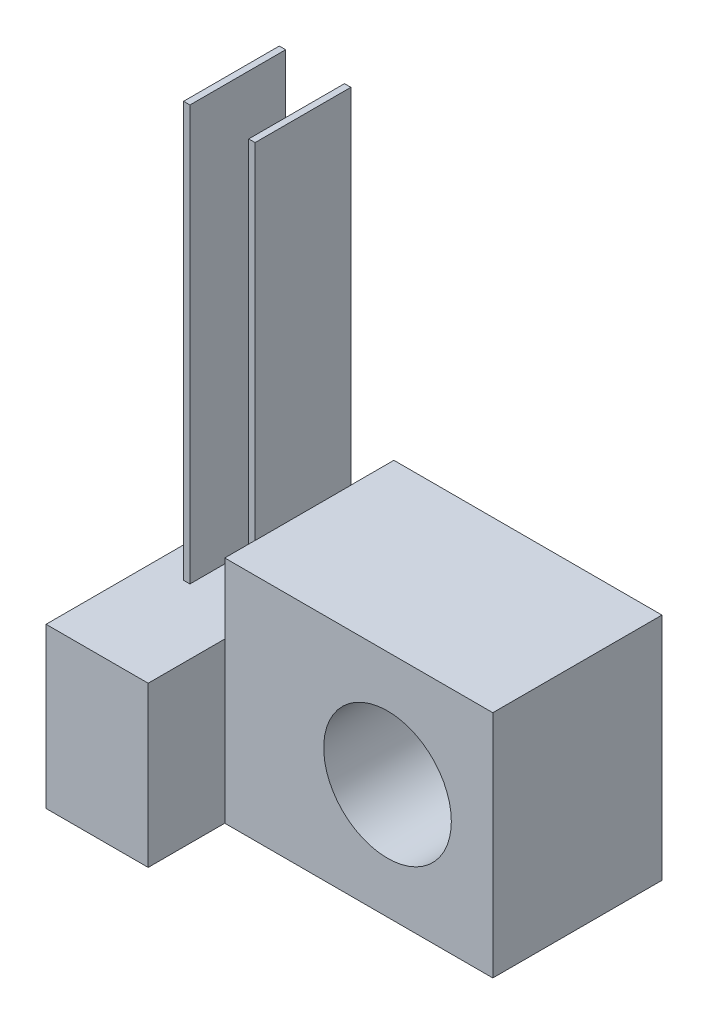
ISO-10303-21;
HEADER;
FILE_DESCRIPTION(('STEP AP214'),'2;1');
FILE_NAME('part.step','',(''),(''),'','','');
FILE_SCHEMA(('AUTOMOTIVE_DESIGN { 1 0 10303 214 1 1 1 1 }'));
ENDSEC;
DATA;
#1=APPLICATION_CONTEXT('core data for automotive mechanical design processes');
#2=APPLICATION_PROTOCOL_DEFINITION('international standard','automotive_design',2000,#1);
#3=PRODUCT_CONTEXT('',#1,'mechanical');
#4=PRODUCT('Part','Part','',(#3));
#5=PRODUCT_RELATED_PRODUCT_CATEGORY('part','',(#4));
#6=PRODUCT_DEFINITION_FORMATION('','',#4);
#7=PRODUCT_DEFINITION_CONTEXT('part definition',#1,'design');
#8=PRODUCT_DEFINITION('design','',#6,#7);
#9=PRODUCT_DEFINITION_SHAPE('','',#8);
#10=(LENGTH_UNIT() NAMED_UNIT(*) SI_UNIT(.MILLI.,.METRE.));
#11=(NAMED_UNIT(*) PLANE_ANGLE_UNIT() SI_UNIT($,.RADIAN.));
#12=(NAMED_UNIT(*) SI_UNIT($,.STERADIAN.) SOLID_ANGLE_UNIT());
#13=UNCERTAINTY_MEASURE_WITH_UNIT(LENGTH_MEASURE(1.E-05),#10,'distance_accuracy_value','');
#14=(GEOMETRIC_REPRESENTATION_CONTEXT(3) GLOBAL_UNCERTAINTY_ASSIGNED_CONTEXT((#13)) GLOBAL_UNIT_ASSIGNED_CONTEXT((#10,
#11,#12)) REPRESENTATION_CONTEXT('',''));
#15=CARTESIAN_POINT('',(0.,0.,0.));
#16=DIRECTION('',(0.,0.,1.));
#17=DIRECTION('',(1.,0.,0.));
#18=AXIS2_PLACEMENT_3D('',#15,#16,#17);
#19=CARTESIAN_POINT('',(9.55,56.6995708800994,-500000.));
#20=DIRECTION('',(0.,1.,0.));
#21=DIRECTION('',(0.,0.,1.));
#22=AXIS2_PLACEMENT_3D('',#19,#20,#21);
#23=PLANE('',#22);
#24=DIRECTION('',(0.,0.,1.));
#25=VECTOR('',#24,1.);
#26=CARTESIAN_POINT('',(9.45160588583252,56.6995708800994,0.675963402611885));
#27=LINE('',#26,#25);
#28=CARTESIAN_POINT('',(9.45160588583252,56.6995708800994,0.675963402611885));
#29=VERTEX_POINT('',#28);
#30=CARTESIAN_POINT('',(9.45160588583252,56.6995708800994,2.17596340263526));
#31=VERTEX_POINT('',#30);
#32=EDGE_CURVE('E181',#29,#31,#27,.T.);
#33=ORIENTED_EDGE('',*,*,#32,.F.);
#34=DIRECTION('',(1.,0.,0.));
#35=VECTOR('',#34,1.);
#36=CARTESIAN_POINT('',(9.55000000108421,56.6995708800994,0.675963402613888));
#37=LINE('',#36,#35);
#38=CARTESIAN_POINT('',(9.55,56.6995708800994,0.675963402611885));
#39=VERTEX_POINT('',#38);
#40=EDGE_CURVE('E55',#29,#39,#37,.T.);
#41=ORIENTED_EDGE('',*,*,#40,.T.);
#42=DIRECTION('',(0.,0.,1.));
#43=VECTOR('',#42,1.);
#44=CARTESIAN_POINT('',(9.55,56.6995708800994,-500000.));
#45=LINE('',#44,#43);
#46=CARTESIAN_POINT('',(9.55,56.6995708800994,0.));
#47=VERTEX_POINT('',#46);
#48=EDGE_CURVE('E285',#47,#39,#45,.T.);
#49=ORIENTED_EDGE('',*,*,#48,.F.);
#50=DIRECTION('',(-1.,0.,0.));
#51=VECTOR('',#50,1.);
#52=CARTESIAN_POINT('',(9.55,56.6995708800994,0.));
#53=LINE('',#52,#51);
#54=CARTESIAN_POINT('',(7.95,56.6995708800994,0.));
#55=VERTEX_POINT('',#54);
#56=EDGE_CURVE('E365',#47,#55,#53,.T.);
#57=ORIENTED_EDGE('',*,*,#56,.T.);
#58=DIRECTION('',(0.,0.,1.));
#59=VECTOR('',#58,1.);
#60=CARTESIAN_POINT('',(7.95,56.6995708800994,-500000.));
#61=LINE('',#60,#59);
#62=CARTESIAN_POINT('',(7.95,56.6995708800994,3.85000000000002));
#63=VERTEX_POINT('',#62);
#64=EDGE_CURVE('E296',#55,#63,#61,.T.);
#65=ORIENTED_EDGE('',*,*,#64,.T.);
#66=DIRECTION('',(-1.,0.,0.));
#67=VECTOR('',#66,1.);
#68=CARTESIAN_POINT('',(9.55,56.6995708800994,3.85000000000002));
#69=LINE('',#68,#67);
#70=CARTESIAN_POINT('',(9.55,56.6995708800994,3.85000000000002));
#71=VERTEX_POINT('',#70);
#72=EDGE_CURVE('E248',#71,#63,#69,.T.);
#73=ORIENTED_EDGE('',*,*,#72,.F.);
#74=DIRECTION('',(0.,0.,-1.));
#75=VECTOR('',#74,1.);
#76=CARTESIAN_POINT('',(9.55,56.6995708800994,3.85000000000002));
#77=LINE('',#76,#75);
#78=CARTESIAN_POINT('',(9.55,56.6995708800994,2.65000000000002));
#79=VERTEX_POINT('',#78);
#80=EDGE_CURVE('E257',#71,#79,#77,.T.);
#81=ORIENTED_EDGE('',*,*,#80,.T.);
#82=CARTESIAN_POINT('',(9.55,56.6995708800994,2.17596340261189));
#83=VERTEX_POINT('',#82);
#84=EDGE_CURVE('E297',#83,#79,#45,.T.);
#85=ORIENTED_EDGE('',*,*,#84,.F.);
#86=DIRECTION('',(1.,0.,0.));
#87=VECTOR('',#86,1.);
#88=CARTESIAN_POINT('',(9.55160588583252,56.6995708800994,2.17596340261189));
#89=LINE('',#88,#87);
#90=EDGE_CURVE('E211',#31,#83,#89,.T.);
#91=ORIENTED_EDGE('',*,*,#90,.F.);
#92=EDGE_LOOP('',(#33,#41,#49,#57,#65,#73,#81,#85,#91));
#93=FACE_BOUND('',#92,.T.);
#94=DIRECTION('',(-1.,0.,0.));
#95=VECTOR('',#94,1.);
#96=CARTESIAN_POINT('',(8.53060997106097,56.6995708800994,0.675963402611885));
#97=LINE('',#96,#95);
#98=CARTESIAN_POINT('',(8.53060997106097,56.6995708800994,0.675963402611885));
#99=VERTEX_POINT('',#98);
#100=CARTESIAN_POINT('',(8.43060997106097,56.6995708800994,0.675963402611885));
#101=VERTEX_POINT('',#100);
#102=EDGE_CURVE('E175',#99,#101,#97,.T.);
#103=ORIENTED_EDGE('',*,*,#102,.F.);
#104=DIRECTION('',(0.,0.,-1.));
#105=VECTOR('',#104,1.);
#106=CARTESIAN_POINT('',(8.53060997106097,56.6995708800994,0.675963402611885));
#107=LINE('',#106,#105);
#108=CARTESIAN_POINT('',(8.53060997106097,56.6995708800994,2.17596340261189));
#109=VERTEX_POINT('',#108);
#110=EDGE_CURVE('E186',#109,#99,#107,.T.);
#111=ORIENTED_EDGE('',*,*,#110,.F.);
#112=DIRECTION('',(1.,0.,0.));
#113=VECTOR('',#112,1.);
#114=CARTESIAN_POINT('',(8.53060997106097,56.6995708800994,2.17596340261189));
#115=LINE('',#114,#113);
#116=CARTESIAN_POINT('',(8.43060997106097,56.6995708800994,2.17596340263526));
#117=VERTEX_POINT('',#116);
#118=EDGE_CURVE('E196',#117,#109,#115,.T.);
#119=ORIENTED_EDGE('',*,*,#118,.F.);
#120=DIRECTION('',(0.,0.,1.));
#121=VECTOR('',#120,1.);
#122=CARTESIAN_POINT('',(8.43060997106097,56.6995708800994,0.675963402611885));
#123=LINE('',#122,#121);
#124=EDGE_CURVE('E194',#101,#117,#123,.T.);
#125=ORIENTED_EDGE('',*,*,#124,.F.);
#126=EDGE_LOOP('',(#103,#111,#119,#125));
#127=FACE_BOUND('',#126,.T.);
#128=ADVANCED_FACE('F47',(#93,#127),#23,.T.);
#129=CARTESIAN_POINT('',(13.75,57.7995708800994,-500000.));
#130=DIRECTION('',(0.,1.,0.));
#131=DIRECTION('',(0.,0.,1.));
#132=AXIS2_PLACEMENT_3D('',#129,#130,#131);
#133=PLANE('',#132);
#134=DIRECTION('',(0.,0.,1.));
#135=VECTOR('',#134,1.);
#136=CARTESIAN_POINT('',(9.55,57.7995708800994,-500000.));
#137=LINE('',#136,#135);
#138=CARTESIAN_POINT('',(9.55,57.7995708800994,0.));
#139=VERTEX_POINT('',#138);
#140=CARTESIAN_POINT('',(9.55,57.7995708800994,0.675963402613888));
#141=VERTEX_POINT('',#140);
#142=EDGE_CURVE('E301',#139,#141,#137,.T.);
#143=ORIENTED_EDGE('',*,*,#142,.T.);
#144=DIRECTION('',(1.,0.,0.));
#145=VECTOR('',#144,1.);
#146=CARTESIAN_POINT('',(13.7500000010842,57.7995708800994,0.675963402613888));
#147=LINE('',#146,#145);
#148=CARTESIAN_POINT('',(9.55160588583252,57.7995708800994,0.675963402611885));
#149=VERTEX_POINT('',#148);
#150=EDGE_CURVE('E241',#141,#149,#147,.T.);
#151=ORIENTED_EDGE('',*,*,#150,.T.);
#152=DIRECTION('',(0.,0.,1.));
#153=VECTOR('',#152,1.);
#154=CARTESIAN_POINT('',(9.55160588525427,57.7995708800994,-500000.));
#155=LINE('',#154,#153);
#156=CARTESIAN_POINT('',(9.55160588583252,57.7995708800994,2.17596340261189));
#157=VERTEX_POINT('',#156);
#158=EDGE_CURVE('E12',#149,#157,#155,.T.);
#159=ORIENTED_EDGE('',*,*,#158,.T.);
#160=DIRECTION('',(-1.,0.,0.));
#161=VECTOR('',#160,1.);
#162=CARTESIAN_POINT('',(13.75,57.7995708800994,2.17596340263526));
#163=LINE('',#162,#161);
#164=CARTESIAN_POINT('',(9.55,57.7995708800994,2.17596340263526));
#165=VERTEX_POINT('',#164);
#166=EDGE_CURVE('E235',#157,#165,#163,.T.);
#167=ORIENTED_EDGE('',*,*,#166,.T.);
#168=CARTESIAN_POINT('',(9.55,57.7995708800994,2.65000000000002));
#169=VERTEX_POINT('',#168);
#170=EDGE_CURVE('E396',#165,#169,#137,.T.);
#171=ORIENTED_EDGE('',*,*,#170,.T.);
#172=DIRECTION('',(-1.,0.,0.));
#173=VECTOR('',#172,1.);
#174=CARTESIAN_POINT('',(13.75,57.7995708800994,2.65000000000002));
#175=LINE('',#174,#173);
#176=CARTESIAN_POINT('',(13.75,57.7995708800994,2.65000000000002));
#177=VERTEX_POINT('',#176);
#178=EDGE_CURVE('E383',#177,#169,#175,.T.);
#179=ORIENTED_EDGE('',*,*,#178,.F.);
#180=DIRECTION('',(0.,0.,1.));
#181=VECTOR('',#180,1.);
#182=CARTESIAN_POINT('',(13.75,57.7995708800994,-500000.));
#183=LINE('',#182,#181);
#184=CARTESIAN_POINT('',(13.75,57.7995708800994,0.));
#185=VERTEX_POINT('',#184);
#186=EDGE_CURVE('E395',#185,#177,#183,.T.);
#187=ORIENTED_EDGE('',*,*,#186,.F.);
#188=DIRECTION('',(-1.,0.,0.));
#189=VECTOR('',#188,1.);
#190=CARTESIAN_POINT('',(13.75,57.7995708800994,0.));
#191=LINE('',#190,#189);
#192=EDGE_CURVE('E388',#185,#139,#191,.T.);
#193=ORIENTED_EDGE('',*,*,#192,.T.);
#194=EDGE_LOOP('',(#143,#151,#159,#167,#171,#179,#187,#193));
#195=FACE_BOUND('',#194,.T.);
#196=ADVANCED_FACE('F338',(#195),#133,.T.);
#197=CARTESIAN_POINT('',(9.55,57.7995708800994,-500000.));
#198=DIRECTION('',(-1.,0.,0.));
#199=DIRECTION('',(0.,0.,1.));
#200=AXIS2_PLACEMENT_3D('',#197,#198,#199);
#201=PLANE('',#200);
#202=ORIENTED_EDGE('',*,*,#48,.T.);
#203=DIRECTION('',(0.,1.,0.));
#204=VECTOR('',#203,1.);
#205=CARTESIAN_POINT('',(9.55,57.7995708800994,0.675963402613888));
#206=LINE('',#205,#204);
#207=EDGE_CURVE('E238',#39,#141,#206,.T.);
#208=ORIENTED_EDGE('',*,*,#207,.T.);
#209=ORIENTED_EDGE('',*,*,#142,.F.);
#210=DIRECTION('',(0.,-1.,0.));
#211=VECTOR('',#210,1.);
#212=CARTESIAN_POINT('',(9.55,57.7995708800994,0.));
#213=LINE('',#212,#211);
#214=EDGE_CURVE('E294',#139,#47,#213,.T.);
#215=ORIENTED_EDGE('',*,*,#214,.T.);
#216=EDGE_LOOP('',(#202,#208,#209,#215));
#217=FACE_BOUND('',#216,.T.);
#218=ADVANCED_FACE('F290',(#217),#201,.T.);
#219=ORIENTED_EDGE('',*,*,#170,.F.);
#220=DIRECTION('',(0.,-1.,0.));
#221=VECTOR('',#220,1.);
#222=CARTESIAN_POINT('',(9.55,57.7995708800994,2.17596340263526));
#223=LINE('',#222,#221);
#224=EDGE_CURVE('E232',#165,#83,#223,.T.);
#225=ORIENTED_EDGE('',*,*,#224,.T.);
#226=ORIENTED_EDGE('',*,*,#84,.T.);
#227=DIRECTION('',(0.,-1.,0.));
#228=VECTOR('',#227,1.);
#229=CARTESIAN_POINT('',(9.55,57.7995708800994,2.65000000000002));
#230=LINE('',#229,#228);
#231=EDGE_CURVE('E267',#169,#79,#230,.T.);
#232=ORIENTED_EDGE('',*,*,#231,.F.);
#233=EDGE_LOOP('',(#219,#225,#226,#232));
#234=FACE_BOUND('',#233,.T.);
#235=ADVANCED_FACE('F378',(#234),#201,.T.);
#236=CARTESIAN_POINT('',(13.75,54.1995708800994,2.65000000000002));
#237=DIRECTION('',(0.,0.,-1.));
#238=DIRECTION('',(-1.,0.,0.));
#239=AXIS2_PLACEMENT_3D('',#236,#237,#238);
#240=PLANE('',#239);
#241=CARTESIAN_POINT('',(12.1,55.9995708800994,2.65000000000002));
#242=DIRECTION('',(0.,0.,1.));
#243=DIRECTION('',(1.,0.,0.));
#244=AXIS2_PLACEMENT_3D('',#241,#242,#243);
#245=CIRCLE('',#244,1.);
#246=CARTESIAN_POINT('',(13.1,55.9995708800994,2.65000000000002));
#247=VERTEX_POINT('',#246);
#248=EDGE_CURVE('E309',#247,#247,#245,.T.);
#249=ORIENTED_EDGE('',*,*,#248,.F.);
#250=EDGE_LOOP('',(#249));
#251=FACE_BOUND('',#250,.T.);
#252=DIRECTION('',(0.,1.,0.));
#253=VECTOR('',#252,1.);
#254=CARTESIAN_POINT('',(9.55,56.6995708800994,2.65000000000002));
#255=LINE('',#254,#253);
#256=CARTESIAN_POINT('',(9.55,54.1995708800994,2.65000000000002));
#257=VERTEX_POINT('',#256);
#258=EDGE_CURVE('E244',#257,#79,#255,.T.);
#259=ORIENTED_EDGE('',*,*,#258,.F.);
#260=DIRECTION('',(1.,0.,0.));
#261=VECTOR('',#260,1.);
#262=CARTESIAN_POINT('',(13.75,54.1995708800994,2.65000000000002));
#263=LINE('',#262,#261);
#264=CARTESIAN_POINT('',(13.75,54.1995708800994,2.65000000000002));
#265=VERTEX_POINT('',#264);
#266=EDGE_CURVE('E264',#257,#265,#263,.T.);
#267=ORIENTED_EDGE('',*,*,#266,.T.);
#268=DIRECTION('',(0.,1.,0.));
#269=VECTOR('',#268,1.);
#270=CARTESIAN_POINT('',(13.75,57.7995708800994,2.65000000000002));
#271=LINE('',#270,#269);
#272=EDGE_CURVE('E261',#265,#177,#271,.T.);
#273=ORIENTED_EDGE('',*,*,#272,.T.);
#274=ORIENTED_EDGE('',*,*,#178,.T.);
#275=ORIENTED_EDGE('',*,*,#231,.T.);
#276=EDGE_LOOP('',(#259,#267,#273,#274,#275));
#277=FACE_BOUND('',#276,.T.);
#278=ADVANCED_FACE('F334',(#251,#277),#240,.F.);
#279=CARTESIAN_POINT('',(9.1,55.9995708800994,-1.));
#280=DIRECTION('',(0.,0.,1.));
#281=DIRECTION('',(1.,0.,0.));
#282=AXIS2_PLACEMENT_3D('',#279,#280,#281);
#283=PLANE('',#282);
#284=CARTESIAN_POINT('',(9.1,55.9995708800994,-1.));
#285=DIRECTION('',(0.,0.,1.));
#286=DIRECTION('',(1.,0.,0.));
#287=AXIS2_PLACEMENT_3D('',#284,#285,#286);
#288=CIRCLE('',#287,0.500000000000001);
#289=CARTESIAN_POINT('',(9.6,55.9995708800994,-1.));
#290=VERTEX_POINT('',#289);
#291=EDGE_CURVE('E313',#290,#290,#288,.T.);
#292=ORIENTED_EDGE('',*,*,#291,.F.);
#293=EDGE_LOOP('',(#292));
#294=FACE_BOUND('',#293,.T.);
#295=ADVANCED_FACE('F325',(#294),#283,.F.);
#296=CARTESIAN_POINT('',(9.1,55.9995708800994,-1.));
#297=DIRECTION('',(0.,0.,1.));
#298=DIRECTION('',(1.,0.,0.));
#299=AXIS2_PLACEMENT_3D('',#296,#297,#298);
#300=CYLINDRICAL_SURFACE('',#299,0.500000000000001);
#301=ORIENTED_EDGE('',*,*,#291,.T.);
#302=EDGE_LOOP('',(#301));
#303=FACE_BOUND('',#302,.T.);
#304=CARTESIAN_POINT('',(9.1,55.9995708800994,0.));
#305=DIRECTION('',(0.,0.,1.));
#306=DIRECTION('',(1.,0.,0.));
#307=AXIS2_PLACEMENT_3D('',#304,#305,#306);
#308=CIRCLE('',#307,0.500000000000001);
#309=CARTESIAN_POINT('',(9.6,55.9995708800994,0.));
#310=VERTEX_POINT('',#309);
#311=EDGE_CURVE('E260',#310,#310,#308,.T.);
#312=ORIENTED_EDGE('',*,*,#311,.F.);
#313=EDGE_LOOP('',(#312));
#314=FACE_BOUND('',#313,.T.);
#315=ADVANCED_FACE('F323',(#303,#314),#300,.T.);
#316=CARTESIAN_POINT('',(15.,47.2495708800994,0.));
#317=DIRECTION('',(0.,0.,-1.));
#318=DIRECTION('',(-1.,0.,0.));
#319=AXIS2_PLACEMENT_3D('',#316,#317,#318);
#320=PLANE('',#319);
#321=DIRECTION('',(1.,0.,0.));
#322=VECTOR('',#321,1.);
#323=CARTESIAN_POINT('',(13.75,54.1995708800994,0.));
#324=LINE('',#323,#322);
#325=CARTESIAN_POINT('',(7.95,54.1995708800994,0.));
#326=VERTEX_POINT('',#325);
#327=CARTESIAN_POINT('',(13.75,54.1995708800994,0.));
#328=VERTEX_POINT('',#327);
#329=EDGE_CURVE('E393',#326,#328,#324,.T.);
#330=ORIENTED_EDGE('',*,*,#329,.F.);
#331=DIRECTION('',(0.,-1.,0.));
#332=VECTOR('',#331,1.);
#333=CARTESIAN_POINT('',(7.95,56.6995708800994,0.));
#334=LINE('',#333,#332);
#335=EDGE_CURVE('E363',#55,#326,#334,.T.);
#336=ORIENTED_EDGE('',*,*,#335,.F.);
#337=ORIENTED_EDGE('',*,*,#56,.F.);
#338=ORIENTED_EDGE('',*,*,#214,.F.);
#339=ORIENTED_EDGE('',*,*,#192,.F.);
#340=DIRECTION('',(0.,1.,0.));
#341=VECTOR('',#340,1.);
#342=CARTESIAN_POINT('',(13.75,57.7995708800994,0.));
#343=LINE('',#342,#341);
#344=EDGE_CURVE('E312',#328,#185,#343,.T.);
#345=ORIENTED_EDGE('',*,*,#344,.F.);
#346=EDGE_LOOP('',(#330,#336,#337,#338,#339,#345));
#347=FACE_BOUND('',#346,.T.);
#348=ORIENTED_EDGE('',*,*,#311,.T.);
#349=EDGE_LOOP('',(#348));
#350=FACE_BOUND('',#349,.T.);
#351=CARTESIAN_POINT('',(12.1,55.9995708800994,0.));
#352=DIRECTION('',(0.,0.,-1.));
#353=DIRECTION('',(-1.,0.,0.));
#354=AXIS2_PLACEMENT_3D('',#351,#352,#353);
#355=CIRCLE('',#354,1.);
#356=CARTESIAN_POINT('',(11.1,55.9995708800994,0.));
#357=VERTEX_POINT('',#356);
#358=EDGE_CURVE('E310',#357,#357,#355,.F.);
#359=ORIENTED_EDGE('',*,*,#358,.T.);
#360=EDGE_LOOP('',(#359));
#361=FACE_BOUND('',#360,.T.);
#362=ADVANCED_FACE('F320',(#347,#350,#361),#320,.T.);
#363=CARTESIAN_POINT('',(12.1,55.9995708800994,-500000.));
#364=DIRECTION('',(0.,0.,1.));
#365=DIRECTION('',(1.,0.,0.));
#366=AXIS2_PLACEMENT_3D('',#363,#364,#365);
#367=CYLINDRICAL_SURFACE('',#366,1.);
#368=ORIENTED_EDGE('',*,*,#358,.F.);
#369=EDGE_LOOP('',(#368));
#370=FACE_BOUND('',#369,.T.);
#371=ORIENTED_EDGE('',*,*,#248,.T.);
#372=EDGE_LOOP('',(#371));
#373=FACE_BOUND('',#372,.T.);
#374=ADVANCED_FACE('F331',(#370,#373),#367,.F.);
#375=CARTESIAN_POINT('',(13.75,57.7995708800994,-500000.));
#376=DIRECTION('',(1.,0.,0.));
#377=DIRECTION('',(0.,0.,-1.));
#378=AXIS2_PLACEMENT_3D('',#375,#376,#377);
#379=PLANE('',#378);
#380=DIRECTION('',(0.,0.,1.));
#381=VECTOR('',#380,1.);
#382=CARTESIAN_POINT('',(13.75,54.1995708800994,-500000.));
#383=LINE('',#382,#381);
#384=EDGE_CURVE('E306',#328,#265,#383,.T.);
#385=ORIENTED_EDGE('',*,*,#384,.F.);
#386=ORIENTED_EDGE('',*,*,#344,.T.);
#387=ORIENTED_EDGE('',*,*,#186,.T.);
#388=ORIENTED_EDGE('',*,*,#272,.F.);
#389=EDGE_LOOP('',(#385,#386,#387,#388));
#390=FACE_BOUND('',#389,.T.);
#391=ADVANCED_FACE('F348',(#390),#379,.T.);
#392=CARTESIAN_POINT('',(7.95,56.6995708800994,-500000.));
#393=DIRECTION('',(-1.,0.,0.));
#394=DIRECTION('',(0.,0.,1.));
#395=AXIS2_PLACEMENT_3D('',#392,#393,#394);
#396=PLANE('',#395);
#397=ORIENTED_EDGE('',*,*,#64,.F.);
#398=ORIENTED_EDGE('',*,*,#335,.T.);
#399=DIRECTION('',(0.,0.,1.));
#400=VECTOR('',#399,1.);
#401=CARTESIAN_POINT('',(7.95,54.1995708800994,-500000.));
#402=LINE('',#401,#400);
#403=CARTESIAN_POINT('',(7.95,54.1995708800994,3.85000000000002));
#404=VERTEX_POINT('',#403);
#405=EDGE_CURVE('E299',#326,#404,#402,.T.);
#406=ORIENTED_EDGE('',*,*,#405,.T.);
#407=DIRECTION('',(0.,-1.,0.));
#408=VECTOR('',#407,1.);
#409=CARTESIAN_POINT('',(7.95,56.6995708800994,3.85000000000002));
#410=LINE('',#409,#408);
#411=EDGE_CURVE('E251',#63,#404,#410,.T.);
#412=ORIENTED_EDGE('',*,*,#411,.F.);
#413=EDGE_LOOP('',(#397,#398,#406,#412));
#414=FACE_BOUND('',#413,.T.);
#415=ADVANCED_FACE('F350',(#414),#396,.T.);
#416=CARTESIAN_POINT('',(13.75,54.1995708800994,-500000.));
#417=DIRECTION('',(0.,-1.,0.));
#418=DIRECTION('',(0.,0.,-1.));
#419=AXIS2_PLACEMENT_3D('',#416,#417,#418);
#420=PLANE('',#419);
#421=ORIENTED_EDGE('',*,*,#405,.F.);
#422=ORIENTED_EDGE('',*,*,#329,.T.);
#423=ORIENTED_EDGE('',*,*,#384,.T.);
#424=ORIENTED_EDGE('',*,*,#266,.F.);
#425=DIRECTION('',(0.,0.,-1.));
#426=VECTOR('',#425,1.);
#427=CARTESIAN_POINT('',(9.55,54.1995708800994,3.85000000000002));
#428=LINE('',#427,#426);
#429=CARTESIAN_POINT('',(9.55,54.1995708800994,3.85000000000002));
#430=VERTEX_POINT('',#429);
#431=EDGE_CURVE('E256',#430,#257,#428,.T.);
#432=ORIENTED_EDGE('',*,*,#431,.F.);
#433=DIRECTION('',(1.,0.,0.));
#434=VECTOR('',#433,1.);
#435=CARTESIAN_POINT('',(9.55,54.1995708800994,3.85000000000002));
#436=LINE('',#435,#434);
#437=EDGE_CURVE('E254',#404,#430,#436,.T.);
#438=ORIENTED_EDGE('',*,*,#437,.F.);
#439=EDGE_LOOP('',(#421,#422,#423,#424,#432,#438));
#440=FACE_BOUND('',#439,.T.);
#441=ADVANCED_FACE('F49',(#440),#420,.T.);
#442=CARTESIAN_POINT('',(9.55,56.6995708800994,3.85000000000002));
#443=DIRECTION('',(-1.,0.,0.));
#444=DIRECTION('',(0.,0.,1.));
#445=AXIS2_PLACEMENT_3D('',#442,#443,#444);
#446=PLANE('',#445);
#447=ORIENTED_EDGE('',*,*,#258,.T.);
#448=ORIENTED_EDGE('',*,*,#80,.F.);
#449=DIRECTION('',(0.,1.,0.));
#450=VECTOR('',#449,1.);
#451=CARTESIAN_POINT('',(9.55,56.6995708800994,3.85000000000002));
#452=LINE('',#451,#450);
#453=EDGE_CURVE('E245',#430,#71,#452,.T.);
#454=ORIENTED_EDGE('',*,*,#453,.F.);
#455=ORIENTED_EDGE('',*,*,#431,.T.);
#456=EDGE_LOOP('',(#447,#448,#454,#455));
#457=FACE_BOUND('',#456,.T.);
#458=ADVANCED_FACE('F358',(#457),#446,.F.);
#459=CARTESIAN_POINT('',(9.55,54.1995708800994,3.85000000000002));
#460=DIRECTION('',(0.,0.,-1.));
#461=DIRECTION('',(-1.,0.,0.));
#462=AXIS2_PLACEMENT_3D('',#459,#460,#461);
#463=PLANE('',#462);
#464=ORIENTED_EDGE('',*,*,#453,.T.);
#465=ORIENTED_EDGE('',*,*,#72,.T.);
#466=ORIENTED_EDGE('',*,*,#411,.T.);
#467=ORIENTED_EDGE('',*,*,#437,.T.);
#468=EDGE_LOOP('',(#464,#465,#466,#467));
#469=FACE_BOUND('',#468,.T.);
#470=ADVANCED_FACE('F367',(#469),#463,.F.);
#471=CARTESIAN_POINT('',(9.55160588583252,63.1995708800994,0.675963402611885));
#472=DIRECTION('',(-1.,0.,0.));
#473=DIRECTION('',(0.,0.,1.));
#474=AXIS2_PLACEMENT_3D('',#471,#472,#473);
#475=PLANE('',#474);
#476=ORIENTED_EDGE('',*,*,#158,.F.);
#477=DIRECTION('',(0.,-1.,0.));
#478=VECTOR('',#477,1.);
#479=CARTESIAN_POINT('',(9.55160588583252,63.1995708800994,0.675963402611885));
#480=LINE('',#479,#478);
#481=CARTESIAN_POINT('',(9.55160588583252,63.1995708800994,0.675963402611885));
#482=VERTEX_POINT('',#481);
#483=EDGE_CURVE('E229',#482,#149,#480,.T.);
#484=ORIENTED_EDGE('',*,*,#483,.F.);
#485=DIRECTION('',(0.,0.,-1.));
#486=VECTOR('',#485,1.);
#487=CARTESIAN_POINT('',(9.55160588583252,63.1995708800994,0.675963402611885));
#488=LINE('',#487,#486);
#489=CARTESIAN_POINT('',(9.55160588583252,63.1995708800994,2.17596340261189));
#490=VERTEX_POINT('',#489);
#491=EDGE_CURVE('E213',#490,#482,#488,.T.);
#492=ORIENTED_EDGE('',*,*,#491,.F.);
#493=DIRECTION('',(0.,-1.,0.));
#494=VECTOR('',#493,1.);
#495=CARTESIAN_POINT('',(9.55160588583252,63.1995708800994,2.17596340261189));
#496=LINE('',#495,#494);
#497=EDGE_CURVE('E222',#490,#157,#496,.T.);
#498=ORIENTED_EDGE('',*,*,#497,.T.);
#499=EDGE_LOOP('',(#476,#484,#492,#498));
#500=FACE_BOUND('',#499,.T.);
#501=ADVANCED_FACE('F406',(#500),#475,.F.);
#502=CARTESIAN_POINT('',(9.55160588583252,63.1995708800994,0.675963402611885));
#503=DIRECTION('',(0.,0.,1.));
#504=DIRECTION('',(1.,0.,0.));
#505=AXIS2_PLACEMENT_3D('',#502,#503,#504);
#506=PLANE('',#505);
#507=ORIENTED_EDGE('',*,*,#150,.F.);
#508=ORIENTED_EDGE('',*,*,#207,.F.);
#509=ORIENTED_EDGE('',*,*,#40,.F.);
#510=DIRECTION('',(0.,-1.,0.));
#511=VECTOR('',#510,1.);
#512=CARTESIAN_POINT('',(9.45160588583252,63.1995708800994,0.675963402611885));
#513=LINE('',#512,#511);
#514=CARTESIAN_POINT('',(9.45160588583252,63.1995708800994,0.675963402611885));
#515=VERTEX_POINT('',#514);
#516=EDGE_CURVE('E226',#515,#29,#513,.T.);
#517=ORIENTED_EDGE('',*,*,#516,.F.);
#518=DIRECTION('',(-1.,0.,0.));
#519=VECTOR('',#518,1.);
#520=CARTESIAN_POINT('',(9.55160588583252,63.1995708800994,0.675963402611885));
#521=LINE('',#520,#519);
#522=EDGE_CURVE('E216',#482,#515,#521,.T.);
#523=ORIENTED_EDGE('',*,*,#522,.F.);
#524=ORIENTED_EDGE('',*,*,#483,.T.);
#525=EDGE_LOOP('',(#507,#508,#509,#517,#523,#524));
#526=FACE_BOUND('',#525,.T.);
#527=ADVANCED_FACE('F402',(#526),#506,.F.);
#528=CARTESIAN_POINT('',(9.45160588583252,63.1995708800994,0.675963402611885));
#529=DIRECTION('',(1.,0.,0.));
#530=DIRECTION('',(0.,0.,-1.));
#531=AXIS2_PLACEMENT_3D('',#528,#529,#530);
#532=PLANE('',#531);
#533=ORIENTED_EDGE('',*,*,#32,.T.);
#534=DIRECTION('',(0.,-1.,0.));
#535=VECTOR('',#534,1.);
#536=CARTESIAN_POINT('',(9.45160588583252,63.1995708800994,2.17596340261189));
#537=LINE('',#536,#535);
#538=CARTESIAN_POINT('',(9.45160588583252,63.1995708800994,2.17596340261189));
#539=VERTEX_POINT('',#538);
#540=EDGE_CURVE('E70',#539,#31,#537,.T.);
#541=ORIENTED_EDGE('',*,*,#540,.F.);
#542=DIRECTION('',(0.,0.,1.));
#543=VECTOR('',#542,1.);
#544=CARTESIAN_POINT('',(9.45160588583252,63.1995708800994,0.675963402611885));
#545=LINE('',#544,#543);
#546=EDGE_CURVE('E218',#515,#539,#545,.T.);
#547=ORIENTED_EDGE('',*,*,#546,.F.);
#548=ORIENTED_EDGE('',*,*,#516,.T.);
#549=EDGE_LOOP('',(#533,#541,#547,#548));
#550=FACE_BOUND('',#549,.T.);
#551=ADVANCED_FACE('F413',(#550),#532,.F.);
#552=CARTESIAN_POINT('',(9.55160588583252,63.1995708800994,2.17596340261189));
#553=DIRECTION('',(0.,0.,-1.));
#554=DIRECTION('',(-1.,0.,0.));
#555=AXIS2_PLACEMENT_3D('',#552,#553,#554);
#556=PLANE('',#555);
#557=ORIENTED_EDGE('',*,*,#166,.F.);
#558=ORIENTED_EDGE('',*,*,#497,.F.);
#559=DIRECTION('',(1.,0.,0.));
#560=VECTOR('',#559,1.);
#561=CARTESIAN_POINT('',(9.55160588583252,63.1995708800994,2.17596340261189));
#562=LINE('',#561,#560);
#563=EDGE_CURVE('E220',#539,#490,#562,.T.);
#564=ORIENTED_EDGE('',*,*,#563,.F.);
#565=ORIENTED_EDGE('',*,*,#540,.T.);
#566=ORIENTED_EDGE('',*,*,#90,.T.);
#567=ORIENTED_EDGE('',*,*,#224,.F.);
#568=EDGE_LOOP('',(#557,#558,#564,#565,#566,#567));
#569=FACE_BOUND('',#568,.T.);
#570=ADVANCED_FACE('F408',(#569),#556,.F.);
#571=CARTESIAN_POINT('',(9.55160588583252,63.1995708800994,0.675963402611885));
#572=DIRECTION('',(0.,-1.,0.));
#573=DIRECTION('',(0.,0.,-1.));
#574=AXIS2_PLACEMENT_3D('',#571,#572,#573);
#575=PLANE('',#574);
#576=ORIENTED_EDGE('',*,*,#491,.T.);
#577=ORIENTED_EDGE('',*,*,#522,.T.);
#578=ORIENTED_EDGE('',*,*,#546,.T.);
#579=ORIENTED_EDGE('',*,*,#563,.T.);
#580=EDGE_LOOP('',(#576,#577,#578,#579));
#581=FACE_BOUND('',#580,.T.);
#582=ADVANCED_FACE('F410',(#581),#575,.F.);
#583=CARTESIAN_POINT('',(8.53060997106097,63.1995708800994,0.675963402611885));
#584=DIRECTION('',(-1.,0.,0.));
#585=DIRECTION('',(0.,0.,1.));
#586=AXIS2_PLACEMENT_3D('',#583,#584,#585);
#587=PLANE('',#586);
#588=ORIENTED_EDGE('',*,*,#110,.T.);
#589=DIRECTION('',(0.,-1.,0.));
#590=VECTOR('',#589,1.);
#591=CARTESIAN_POINT('',(8.53060997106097,63.1995708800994,0.675963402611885));
#592=LINE('',#591,#590);
#593=CARTESIAN_POINT('',(8.53060997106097,63.1995708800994,0.675963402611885));
#594=VERTEX_POINT('',#593);
#595=EDGE_CURVE('E170',#594,#99,#592,.T.);
#596=ORIENTED_EDGE('',*,*,#595,.F.);
#597=DIRECTION('',(0.,0.,-1.));
#598=VECTOR('',#597,1.);
#599=CARTESIAN_POINT('',(8.53060997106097,63.1995708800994,0.675963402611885));
#600=LINE('',#599,#598);
#601=CARTESIAN_POINT('',(8.53060997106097,63.1995708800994,2.17596340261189));
#602=VERTEX_POINT('',#601);
#603=EDGE_CURVE('E200',#602,#594,#600,.T.);
#604=ORIENTED_EDGE('',*,*,#603,.F.);
#605=DIRECTION('',(0.,-1.,0.));
#606=VECTOR('',#605,1.);
#607=CARTESIAN_POINT('',(8.53060997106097,63.1995708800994,2.17596340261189));
#608=LINE('',#607,#606);
#609=EDGE_CURVE('E189',#602,#109,#608,.T.);
#610=ORIENTED_EDGE('',*,*,#609,.T.);
#611=EDGE_LOOP('',(#588,#596,#604,#610));
#612=FACE_BOUND('',#611,.T.);
#613=ADVANCED_FACE('F187',(#612),#587,.F.);
#614=CARTESIAN_POINT('',(8.53060997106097,63.1995708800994,0.675963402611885));
#615=DIRECTION('',(0.,0.,1.));
#616=DIRECTION('',(1.,0.,0.));
#617=AXIS2_PLACEMENT_3D('',#614,#615,#616);
#618=PLANE('',#617);
#619=ORIENTED_EDGE('',*,*,#102,.T.);
#620=DIRECTION('',(0.,-1.,0.));
#621=VECTOR('',#620,1.);
#622=CARTESIAN_POINT('',(8.43060997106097,63.1995708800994,0.675963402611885));
#623=LINE('',#622,#621);
#624=CARTESIAN_POINT('',(8.43060997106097,63.1995708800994,0.675963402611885));
#625=VERTEX_POINT('',#624);
#626=EDGE_CURVE('E182',#625,#101,#623,.T.);
#627=ORIENTED_EDGE('',*,*,#626,.F.);
#628=DIRECTION('',(-1.,0.,0.));
#629=VECTOR('',#628,1.);
#630=CARTESIAN_POINT('',(8.53060997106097,63.1995708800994,0.675963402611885));
#631=LINE('',#630,#629);
#632=EDGE_CURVE('E177',#594,#625,#631,.T.);
#633=ORIENTED_EDGE('',*,*,#632,.F.);
#634=ORIENTED_EDGE('',*,*,#595,.T.);
#635=EDGE_LOOP('',(#619,#627,#633,#634));
#636=FACE_BOUND('',#635,.T.);
#637=ADVANCED_FACE('F172',(#636),#618,.F.);
#638=CARTESIAN_POINT('',(8.43060997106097,63.1995708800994,0.675963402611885));
#639=DIRECTION('',(1.,0.,0.));
#640=DIRECTION('',(0.,0.,-1.));
#641=AXIS2_PLACEMENT_3D('',#638,#639,#640);
#642=PLANE('',#641);
#643=ORIENTED_EDGE('',*,*,#124,.T.);
#644=DIRECTION('',(0.,-1.,0.));
#645=VECTOR('',#644,1.);
#646=CARTESIAN_POINT('',(8.43060997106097,63.1995708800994,2.17596340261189));
#647=LINE('',#646,#645);
#648=CARTESIAN_POINT('',(8.43060997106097,63.1995708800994,2.17596340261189));
#649=VERTEX_POINT('',#648);
#650=EDGE_CURVE('E62',#649,#117,#647,.T.);
#651=ORIENTED_EDGE('',*,*,#650,.F.);
#652=DIRECTION('',(0.,0.,1.));
#653=VECTOR('',#652,1.);
#654=CARTESIAN_POINT('',(8.43060997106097,63.1995708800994,0.675963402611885));
#655=LINE('',#654,#653);
#656=EDGE_CURVE('E203',#625,#649,#655,.T.);
#657=ORIENTED_EDGE('',*,*,#656,.F.);
#658=ORIENTED_EDGE('',*,*,#626,.T.);
#659=EDGE_LOOP('',(#643,#651,#657,#658));
#660=FACE_BOUND('',#659,.T.);
#661=ADVANCED_FACE('F519',(#660),#642,.F.);
#662=CARTESIAN_POINT('',(8.53060997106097,63.1995708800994,2.17596340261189));
#663=DIRECTION('',(0.,0.,-1.));
#664=DIRECTION('',(-1.,0.,0.));
#665=AXIS2_PLACEMENT_3D('',#662,#663,#664);
#666=PLANE('',#665);
#667=ORIENTED_EDGE('',*,*,#118,.T.);
#668=ORIENTED_EDGE('',*,*,#609,.F.);
#669=DIRECTION('',(1.,0.,0.));
#670=VECTOR('',#669,1.);
#671=CARTESIAN_POINT('',(8.53060997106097,63.1995708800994,2.17596340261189));
#672=LINE('',#671,#670);
#673=EDGE_CURVE('E205',#649,#602,#672,.T.);
#674=ORIENTED_EDGE('',*,*,#673,.F.);
#675=ORIENTED_EDGE('',*,*,#650,.T.);
#676=EDGE_LOOP('',(#667,#668,#674,#675));
#677=FACE_BOUND('',#676,.T.);
#678=ADVANCED_FACE('F526',(#677),#666,.F.);
#679=CARTESIAN_POINT('',(8.53060997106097,63.1995708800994,2.17596340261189));
#680=DIRECTION('',(0.,-1.,0.));
#681=DIRECTION('',(0.,0.,-1.));
#682=AXIS2_PLACEMENT_3D('',#679,#680,#681);
#683=PLANE('',#682);
#684=ORIENTED_EDGE('',*,*,#603,.T.);
#685=ORIENTED_EDGE('',*,*,#632,.T.);
#686=ORIENTED_EDGE('',*,*,#656,.T.);
#687=ORIENTED_EDGE('',*,*,#673,.T.);
#688=EDGE_LOOP('',(#684,#685,#686,#687));
#689=FACE_BOUND('',#688,.T.);
#690=ADVANCED_FACE('F534',(#689),#683,.F.);
#691=CLOSED_SHELL('',(#128,#196,#218,#235,#278,#295,#315,#362,#374,#391,#415,#441,#458,#470,
#501,#527,#551,#570,#582,#613,#637,#661,#678,#690));
#692=MANIFOLD_SOLID_BREP('B2',#691);
#693=ADVANCED_BREP_SHAPE_REPRESENTATION('',(#18,#692),#14);
#694=SHAPE_DEFINITION_REPRESENTATION(#9,#693);
ENDSEC;
END-ISO-10303-21;
